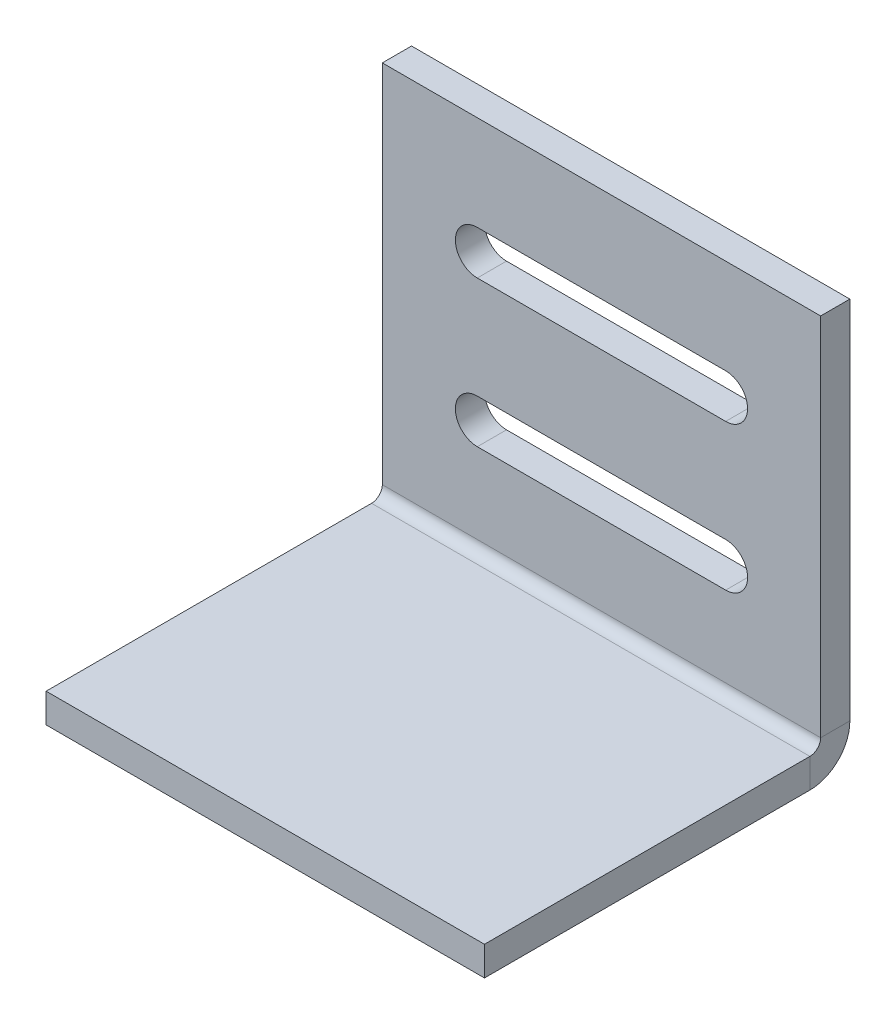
ISO-10303-21;
HEADER;
FILE_DESCRIPTION(('STEP AP214'),'2;1');
FILE_NAME('part.step','',(''),(''),'','','');
FILE_SCHEMA(('AUTOMOTIVE_DESIGN { 1 0 10303 214 1 1 1 1 }'));
ENDSEC;
DATA;
#1=APPLICATION_CONTEXT('core data for automotive mechanical design processes');
#2=APPLICATION_PROTOCOL_DEFINITION('international standard','automotive_design',2000,#1);
#3=PRODUCT_CONTEXT('',#1,'mechanical');
#4=PRODUCT('Part','Part','',(#3));
#5=PRODUCT_RELATED_PRODUCT_CATEGORY('part','',(#4));
#6=PRODUCT_DEFINITION_FORMATION('','',#4);
#7=PRODUCT_DEFINITION_CONTEXT('part definition',#1,'design');
#8=PRODUCT_DEFINITION('design','',#6,#7);
#9=PRODUCT_DEFINITION_SHAPE('','',#8);
#10=(LENGTH_UNIT() NAMED_UNIT(*) SI_UNIT(.MILLI.,.METRE.));
#11=(NAMED_UNIT(*) PLANE_ANGLE_UNIT() SI_UNIT($,.RADIAN.));
#12=(NAMED_UNIT(*) SI_UNIT($,.STERADIAN.) SOLID_ANGLE_UNIT());
#13=UNCERTAINTY_MEASURE_WITH_UNIT(LENGTH_MEASURE(1.E-05),#10,'distance_accuracy_value','');
#14=(GEOMETRIC_REPRESENTATION_CONTEXT(3) GLOBAL_UNCERTAINTY_ASSIGNED_CONTEXT((#13)) GLOBAL_UNIT_ASSIGNED_CONTEXT((#10,
#11,#12)) REPRESENTATION_CONTEXT('',''));
#15=CARTESIAN_POINT('',(0.,0.,0.));
#16=DIRECTION('',(0.,0.,1.));
#17=DIRECTION('',(1.,0.,0.));
#18=AXIS2_PLACEMENT_3D('',#15,#16,#17);
#19=CARTESIAN_POINT('',(-15.,-0.736599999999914,25.008755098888));
#20=DIRECTION('',(0.,1.,0.));
#21=DIRECTION('',(1.,0.,0.));
#22=AXIS2_PLACEMENT_3D('',#19,#20,#21);
#23=PLANE('',#22);
#24=DIRECTION('',(0.,0.,-1.));
#25=VECTOR('',#24,1.);
#26=CARTESIAN_POINT('',(15.,-0.736600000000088,-24.991244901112));
#27=LINE('',#26,#25);
#28=CARTESIAN_POINT('',(15.,-0.736599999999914,25.008755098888));
#29=VERTEX_POINT('',#28);
#30=CARTESIAN_POINT('',(15.,-0.7366,2.7366));
#31=VERTEX_POINT('',#30);
#32=EDGE_CURVE('E50',#29,#31,#27,.T.);
#33=ORIENTED_EDGE('',*,*,#32,.T.);
#34=DIRECTION('',(-1.,0.,0.));
#35=VECTOR('',#34,1.);
#36=CARTESIAN_POINT('',(-15.,-0.736599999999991,2.73660000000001));
#37=LINE('',#36,#35);
#38=CARTESIAN_POINT('',(-15.,-0.736599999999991,2.7366));
#39=VERTEX_POINT('',#38);
#40=EDGE_CURVE('E171',#31,#39,#37,.T.);
#41=ORIENTED_EDGE('',*,*,#40,.T.);
#42=DIRECTION('',(0.,0.,1.));
#43=VECTOR('',#42,1.);
#44=CARTESIAN_POINT('',(-15.,-0.736600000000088,-24.991244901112));
#45=LINE('',#44,#43);
#46=CARTESIAN_POINT('',(-15.,-0.736599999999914,25.008755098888));
#47=VERTEX_POINT('',#46);
#48=EDGE_CURVE('E190',#39,#47,#45,.T.);
#49=ORIENTED_EDGE('',*,*,#48,.T.);
#50=DIRECTION('',(1.,0.,0.));
#51=VECTOR('',#50,1.);
#52=CARTESIAN_POINT('',(-15.,-0.736599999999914,25.008755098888));
#53=LINE('',#52,#51);
#54=EDGE_CURVE('E70',#47,#29,#53,.T.);
#55=ORIENTED_EDGE('',*,*,#54,.T.);
#56=EDGE_LOOP('',(#33,#41,#49,#55));
#57=FACE_BOUND('',#56,.T.);
#58=ADVANCED_FACE('F46',(#57),#23,.T.);
#59=CARTESIAN_POINT('',(-15.,-0.736600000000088,-24.991244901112));
#60=DIRECTION('',(1.,0.,0.));
#61=DIRECTION('',(0.,0.,-1.));
#62=AXIS2_PLACEMENT_3D('',#59,#60,#61);
#63=PLANE('',#62);
#64=DIRECTION('',(0.,1.,0.));
#65=VECTOR('',#64,1.);
#66=CARTESIAN_POINT('',(-15.,-0.736600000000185,2.73660000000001));
#67=LINE('',#66,#65);
#68=CARTESIAN_POINT('',(-15.,-2.7366,2.7366));
#69=VERTEX_POINT('',#68);
#70=EDGE_CURVE('E12',#69,#39,#67,.T.);
#71=ORIENTED_EDGE('',*,*,#70,.F.);
#72=DIRECTION('',(0.,0.,1.));
#73=VECTOR('',#72,1.);
#74=CARTESIAN_POINT('',(-15.,-2.73660000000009,-24.991244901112));
#75=LINE('',#74,#73);
#76=CARTESIAN_POINT('',(-15.,-2.73659999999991,25.008755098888));
#77=VERTEX_POINT('',#76);
#78=EDGE_CURVE('E195',#69,#77,#75,.T.);
#79=ORIENTED_EDGE('',*,*,#78,.T.);
#80=DIRECTION('',(0.,-1.,0.));
#81=VECTOR('',#80,1.);
#82=CARTESIAN_POINT('',(-15.,-0.736599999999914,25.008755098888));
#83=LINE('',#82,#81);
#84=EDGE_CURVE('E208',#47,#77,#83,.T.);
#85=ORIENTED_EDGE('',*,*,#84,.F.);
#86=ORIENTED_EDGE('',*,*,#48,.F.);
#87=EDGE_LOOP('',(#71,#79,#85,#86));
#88=FACE_BOUND('',#87,.T.);
#89=ADVANCED_FACE('F48',(#88),#63,.F.);
#90=CARTESIAN_POINT('',(-15.,-0.736599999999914,25.008755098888));
#91=DIRECTION('',(0.,0.,-1.));
#92=DIRECTION('',(-1.,0.,0.));
#93=AXIS2_PLACEMENT_3D('',#90,#91,#92);
#94=PLANE('',#93);
#95=DIRECTION('',(1.,0.,0.));
#96=VECTOR('',#95,1.);
#97=CARTESIAN_POINT('',(-15.,-2.73659999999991,25.008755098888));
#98=LINE('',#97,#96);
#99=CARTESIAN_POINT('',(15.,-2.73659999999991,25.008755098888));
#100=VERTEX_POINT('',#99);
#101=EDGE_CURVE('E191',#77,#100,#98,.T.);
#102=ORIENTED_EDGE('',*,*,#101,.T.);
#103=DIRECTION('',(0.,-1.,0.));
#104=VECTOR('',#103,1.);
#105=CARTESIAN_POINT('',(15.,-0.736599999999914,25.008755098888));
#106=LINE('',#105,#104);
#107=EDGE_CURVE('E187',#29,#100,#106,.T.);
#108=ORIENTED_EDGE('',*,*,#107,.F.);
#109=ORIENTED_EDGE('',*,*,#54,.F.);
#110=ORIENTED_EDGE('',*,*,#84,.T.);
#111=EDGE_LOOP('',(#102,#108,#109,#110));
#112=FACE_BOUND('',#111,.T.);
#113=ADVANCED_FACE('F213',(#112),#94,.F.);
#114=CARTESIAN_POINT('',(15.,-0.736600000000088,-24.991244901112));
#115=DIRECTION('',(-1.,0.,0.));
#116=DIRECTION('',(0.,0.,1.));
#117=AXIS2_PLACEMENT_3D('',#114,#115,#116);
#118=PLANE('',#117);
#119=DIRECTION('',(0.,-1.,0.));
#120=VECTOR('',#119,1.);
#121=CARTESIAN_POINT('',(15.,-0.736600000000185,2.73660000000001));
#122=LINE('',#121,#120);
#123=CARTESIAN_POINT('',(15.,-2.7366,2.7366));
#124=VERTEX_POINT('',#123);
#125=EDGE_CURVE('E161',#31,#124,#122,.T.);
#126=ORIENTED_EDGE('',*,*,#125,.F.);
#127=ORIENTED_EDGE('',*,*,#32,.F.);
#128=ORIENTED_EDGE('',*,*,#107,.T.);
#129=DIRECTION('',(0.,0.,-1.));
#130=VECTOR('',#129,1.);
#131=CARTESIAN_POINT('',(15.,-2.73660000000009,-24.991244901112));
#132=LINE('',#131,#130);
#133=EDGE_CURVE('E185',#100,#124,#132,.T.);
#134=ORIENTED_EDGE('',*,*,#133,.T.);
#135=EDGE_LOOP('',(#126,#127,#128,#134));
#136=FACE_BOUND('',#135,.T.);
#137=ADVANCED_FACE('F186',(#136),#118,.F.);
#138=CARTESIAN_POINT('',(-15.,-2.73659999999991,25.008755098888));
#139=DIRECTION('',(0.,1.,0.));
#140=DIRECTION('',(1.,0.,0.));
#141=AXIS2_PLACEMENT_3D('',#138,#139,#140);
#142=PLANE('',#141);
#143=DIRECTION('',(-1.,0.,0.));
#144=VECTOR('',#143,1.);
#145=CARTESIAN_POINT('',(-15.,-2.73659999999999,2.7366));
#146=LINE('',#145,#144);
#147=EDGE_CURVE('E55',#124,#69,#146,.T.);
#148=ORIENTED_EDGE('',*,*,#147,.F.);
#149=ORIENTED_EDGE('',*,*,#133,.F.);
#150=ORIENTED_EDGE('',*,*,#101,.F.);
#151=ORIENTED_EDGE('',*,*,#78,.F.);
#152=EDGE_LOOP('',(#148,#149,#150,#151));
#153=FACE_BOUND('',#152,.T.);
#154=ADVANCED_FACE('F194',(#153),#142,.F.);
#155=CARTESIAN_POINT('',(8.50000000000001,18.5,0.));
#156=DIRECTION('',(0.,1.,0.));
#157=DIRECTION('',(0.,0.,1.));
#158=AXIS2_PLACEMENT_3D('',#155,#156,#157);
#159=PLANE('',#158);
#160=DIRECTION('',(-1.,0.,0.));
#161=VECTOR('',#160,1.);
#162=CARTESIAN_POINT('',(8.50000000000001,18.5,2.));
#163=LINE('',#162,#161);
#164=CARTESIAN_POINT('',(8.50000000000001,18.5,2.));
#165=VERTEX_POINT('',#164);
#166=CARTESIAN_POINT('',(-8.49999999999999,18.5,2.));
#167=VERTEX_POINT('',#166);
#168=EDGE_CURVE('E382',#165,#167,#163,.T.);
#169=ORIENTED_EDGE('',*,*,#168,.T.);
#170=DIRECTION('',(0.,0.,1.));
#171=VECTOR('',#170,1.);
#172=CARTESIAN_POINT('',(-8.49999999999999,18.5,0.));
#173=LINE('',#172,#171);
#174=CARTESIAN_POINT('',(-8.49999999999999,18.5,0.));
#175=VERTEX_POINT('',#174);
#176=EDGE_CURVE('E374',#175,#167,#173,.T.);
#177=ORIENTED_EDGE('',*,*,#176,.F.);
#178=DIRECTION('',(-1.,0.,0.));
#179=VECTOR('',#178,1.);
#180=CARTESIAN_POINT('',(8.50000000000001,18.5,0.));
#181=LINE('',#180,#179);
#182=CARTESIAN_POINT('',(8.50000000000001,18.5,0.));
#183=VERTEX_POINT('',#182);
#184=EDGE_CURVE('E321',#183,#175,#181,.T.);
#185=ORIENTED_EDGE('',*,*,#184,.F.);
#186=DIRECTION('',(0.,0.,1.));
#187=VECTOR('',#186,1.);
#188=CARTESIAN_POINT('',(8.50000000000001,18.5,0.));
#189=LINE('',#188,#187);
#190=EDGE_CURVE('E379',#183,#165,#189,.T.);
#191=ORIENTED_EDGE('',*,*,#190,.T.);
#192=EDGE_LOOP('',(#169,#177,#185,#191));
#193=FACE_BOUND('',#192,.T.);
#194=ADVANCED_FACE('F227',(#193),#159,.F.);
#195=CARTESIAN_POINT('',(-8.49999999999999,17.,0.));
#196=DIRECTION('',(0.,0.,1.));
#197=DIRECTION('',(1.,0.,0.));
#198=AXIS2_PLACEMENT_3D('',#195,#196,#197);
#199=CYLINDRICAL_SURFACE('',#198,1.5);
#200=CARTESIAN_POINT('',(-8.49999999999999,17.,2.));
#201=DIRECTION('',(0.,0.,1.));
#202=DIRECTION('',(1.,0.,0.));
#203=AXIS2_PLACEMENT_3D('',#200,#201,#202);
#204=CIRCLE('',#203,1.5);
#205=CARTESIAN_POINT('',(-8.49999999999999,15.5,2.));
#206=VERTEX_POINT('',#205);
#207=EDGE_CURVE('E376',#167,#206,#204,.T.);
#208=ORIENTED_EDGE('',*,*,#207,.T.);
#209=DIRECTION('',(0.,0.,1.));
#210=VECTOR('',#209,1.);
#211=CARTESIAN_POINT('',(-8.49999999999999,15.5,0.));
#212=LINE('',#211,#210);
#213=CARTESIAN_POINT('',(-8.49999999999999,15.5,0.));
#214=VERTEX_POINT('',#213);
#215=EDGE_CURVE('E369',#214,#206,#212,.T.);
#216=ORIENTED_EDGE('',*,*,#215,.F.);
#217=CARTESIAN_POINT('',(-8.49999999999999,17.,0.));
#218=DIRECTION('',(0.,0.,1.));
#219=DIRECTION('',(1.,0.,0.));
#220=AXIS2_PLACEMENT_3D('',#217,#218,#219);
#221=CIRCLE('',#220,1.5);
#222=EDGE_CURVE('E318',#175,#214,#221,.T.);
#223=ORIENTED_EDGE('',*,*,#222,.F.);
#224=ORIENTED_EDGE('',*,*,#176,.T.);
#225=EDGE_LOOP('',(#208,#216,#223,#224));
#226=FACE_BOUND('',#225,.T.);
#227=ADVANCED_FACE('F231',(#226),#199,.F.);
#228=CARTESIAN_POINT('',(8.50000000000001,15.5,0.));
#229=DIRECTION('',(0.,-1.,0.));
#230=DIRECTION('',(0.,0.,-1.));
#231=AXIS2_PLACEMENT_3D('',#228,#229,#230);
#232=PLANE('',#231);
#233=DIRECTION('',(1.,0.,0.));
#234=VECTOR('',#233,1.);
#235=CARTESIAN_POINT('',(8.50000000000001,15.5,2.));
#236=LINE('',#235,#234);
#237=CARTESIAN_POINT('',(8.50000000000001,15.5,2.));
#238=VERTEX_POINT('',#237);
#239=EDGE_CURVE('E371',#206,#238,#236,.T.);
#240=ORIENTED_EDGE('',*,*,#239,.T.);
#241=DIRECTION('',(0.,0.,1.));
#242=VECTOR('',#241,1.);
#243=CARTESIAN_POINT('',(8.50000000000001,15.5,0.));
#244=LINE('',#243,#242);
#245=CARTESIAN_POINT('',(8.50000000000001,15.5,0.));
#246=VERTEX_POINT('',#245);
#247=EDGE_CURVE('E365',#246,#238,#244,.T.);
#248=ORIENTED_EDGE('',*,*,#247,.F.);
#249=DIRECTION('',(1.,0.,0.));
#250=VECTOR('',#249,1.);
#251=CARTESIAN_POINT('',(8.50000000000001,15.5,0.));
#252=LINE('',#251,#250);
#253=EDGE_CURVE('E327',#214,#246,#252,.T.);
#254=ORIENTED_EDGE('',*,*,#253,.F.);
#255=ORIENTED_EDGE('',*,*,#215,.T.);
#256=EDGE_LOOP('',(#240,#248,#254,#255));
#257=FACE_BOUND('',#256,.T.);
#258=ADVANCED_FACE('F237',(#257),#232,.F.);
#259=CARTESIAN_POINT('',(8.50000000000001,17.,0.));
#260=DIRECTION('',(0.,0.,1.));
#261=DIRECTION('',(1.,0.,0.));
#262=AXIS2_PLACEMENT_3D('',#259,#260,#261);
#263=CYLINDRICAL_SURFACE('',#262,1.5);
#264=CARTESIAN_POINT('',(8.50000000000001,17.,2.));
#265=DIRECTION('',(0.,0.,1.));
#266=DIRECTION('',(-1.,0.,0.));
#267=AXIS2_PLACEMENT_3D('',#264,#265,#266);
#268=CIRCLE('',#267,1.5);
#269=EDGE_CURVE('E367',#238,#165,#268,.T.);
#270=ORIENTED_EDGE('',*,*,#269,.T.);
#271=ORIENTED_EDGE('',*,*,#190,.F.);
#272=CARTESIAN_POINT('',(8.50000000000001,17.,0.));
#273=DIRECTION('',(0.,0.,1.));
#274=DIRECTION('',(-1.,0.,0.));
#275=AXIS2_PLACEMENT_3D('',#272,#273,#274);
#276=CIRCLE('',#275,1.5);
#277=EDGE_CURVE('E324',#246,#183,#276,.T.);
#278=ORIENTED_EDGE('',*,*,#277,.F.);
#279=ORIENTED_EDGE('',*,*,#247,.T.);
#280=EDGE_LOOP('',(#270,#271,#278,#279));
#281=FACE_BOUND('',#280,.T.);
#282=ADVANCED_FACE('F247',(#281),#263,.F.);
#283=CARTESIAN_POINT('',(8.50000000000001,8.50000000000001,0.));
#284=DIRECTION('',(0.,1.,0.));
#285=DIRECTION('',(0.,0.,1.));
#286=AXIS2_PLACEMENT_3D('',#283,#284,#285);
#287=PLANE('',#286);
#288=DIRECTION('',(-1.,0.,0.));
#289=VECTOR('',#288,1.);
#290=CARTESIAN_POINT('',(8.50000000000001,8.50000000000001,2.));
#291=LINE('',#290,#289);
#292=CARTESIAN_POINT('',(8.50000000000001,8.50000000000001,2.));
#293=VERTEX_POINT('',#292);
#294=CARTESIAN_POINT('',(-8.49999999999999,8.50000000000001,2.));
#295=VERTEX_POINT('',#294);
#296=EDGE_CURVE('E362',#293,#295,#291,.T.);
#297=ORIENTED_EDGE('',*,*,#296,.T.);
#298=DIRECTION('',(0.,0.,1.));
#299=VECTOR('',#298,1.);
#300=CARTESIAN_POINT('',(-8.49999999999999,8.50000000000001,0.));
#301=LINE('',#300,#299);
#302=CARTESIAN_POINT('',(-8.49999999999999,8.50000000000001,0.));
#303=VERTEX_POINT('',#302);
#304=EDGE_CURVE('E354',#303,#295,#301,.T.);
#305=ORIENTED_EDGE('',*,*,#304,.F.);
#306=DIRECTION('',(-1.,0.,0.));
#307=VECTOR('',#306,1.);
#308=CARTESIAN_POINT('',(8.50000000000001,8.50000000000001,0.));
#309=LINE('',#308,#307);
#310=CARTESIAN_POINT('',(8.50000000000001,8.50000000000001,0.));
#311=VERTEX_POINT('',#310);
#312=EDGE_CURVE('E306',#311,#303,#309,.T.);
#313=ORIENTED_EDGE('',*,*,#312,.F.);
#314=DIRECTION('',(0.,0.,1.));
#315=VECTOR('',#314,1.);
#316=CARTESIAN_POINT('',(8.50000000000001,8.50000000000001,0.));
#317=LINE('',#316,#315);
#318=EDGE_CURVE('E359',#311,#293,#317,.T.);
#319=ORIENTED_EDGE('',*,*,#318,.T.);
#320=EDGE_LOOP('',(#297,#305,#313,#319));
#321=FACE_BOUND('',#320,.T.);
#322=ADVANCED_FACE('F251',(#321),#287,.F.);
#323=CARTESIAN_POINT('',(-8.49999999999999,7.00000000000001,0.));
#324=DIRECTION('',(0.,0.,1.));
#325=DIRECTION('',(1.,0.,0.));
#326=AXIS2_PLACEMENT_3D('',#323,#324,#325);
#327=CYLINDRICAL_SURFACE('',#326,1.5);
#328=CARTESIAN_POINT('',(-8.49999999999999,7.00000000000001,2.));
#329=DIRECTION('',(0.,0.,1.));
#330=DIRECTION('',(1.,0.,0.));
#331=AXIS2_PLACEMENT_3D('',#328,#329,#330);
#332=CIRCLE('',#331,1.5);
#333=CARTESIAN_POINT('',(-8.49999999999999,5.50000000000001,2.));
#334=VERTEX_POINT('',#333);
#335=EDGE_CURVE('E356',#295,#334,#332,.T.);
#336=ORIENTED_EDGE('',*,*,#335,.T.);
#337=DIRECTION('',(0.,0.,1.));
#338=VECTOR('',#337,1.);
#339=CARTESIAN_POINT('',(-8.49999999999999,5.50000000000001,0.));
#340=LINE('',#339,#338);
#341=CARTESIAN_POINT('',(-8.49999999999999,5.50000000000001,0.));
#342=VERTEX_POINT('',#341);
#343=EDGE_CURVE('E349',#342,#334,#340,.T.);
#344=ORIENTED_EDGE('',*,*,#343,.F.);
#345=CARTESIAN_POINT('',(-8.49999999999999,7.00000000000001,0.));
#346=DIRECTION('',(0.,0.,1.));
#347=DIRECTION('',(1.,0.,0.));
#348=AXIS2_PLACEMENT_3D('',#345,#346,#347);
#349=CIRCLE('',#348,1.5);
#350=EDGE_CURVE('E303',#303,#342,#349,.T.);
#351=ORIENTED_EDGE('',*,*,#350,.F.);
#352=ORIENTED_EDGE('',*,*,#304,.T.);
#353=EDGE_LOOP('',(#336,#344,#351,#352));
#354=FACE_BOUND('',#353,.T.);
#355=ADVANCED_FACE('F255',(#354),#327,.F.);
#356=CARTESIAN_POINT('',(8.50000000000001,5.50000000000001,0.));
#357=DIRECTION('',(0.,-1.,0.));
#358=DIRECTION('',(0.,0.,-1.));
#359=AXIS2_PLACEMENT_3D('',#356,#357,#358);
#360=PLANE('',#359);
#361=DIRECTION('',(1.,0.,0.));
#362=VECTOR('',#361,1.);
#363=CARTESIAN_POINT('',(8.50000000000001,5.50000000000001,2.));
#364=LINE('',#363,#362);
#365=CARTESIAN_POINT('',(8.50000000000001,5.50000000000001,2.));
#366=VERTEX_POINT('',#365);
#367=EDGE_CURVE('E351',#334,#366,#364,.T.);
#368=ORIENTED_EDGE('',*,*,#367,.T.);
#369=DIRECTION('',(0.,0.,1.));
#370=VECTOR('',#369,1.);
#371=CARTESIAN_POINT('',(8.50000000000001,5.50000000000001,0.));
#372=LINE('',#371,#370);
#373=CARTESIAN_POINT('',(8.50000000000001,5.50000000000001,0.));
#374=VERTEX_POINT('',#373);
#375=EDGE_CURVE('E345',#374,#366,#372,.T.);
#376=ORIENTED_EDGE('',*,*,#375,.F.);
#377=DIRECTION('',(1.,0.,0.));
#378=VECTOR('',#377,1.);
#379=CARTESIAN_POINT('',(8.50000000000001,5.50000000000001,0.));
#380=LINE('',#379,#378);
#381=EDGE_CURVE('E315',#342,#374,#380,.T.);
#382=ORIENTED_EDGE('',*,*,#381,.F.);
#383=ORIENTED_EDGE('',*,*,#343,.T.);
#384=EDGE_LOOP('',(#368,#376,#382,#383));
#385=FACE_BOUND('',#384,.T.);
#386=ADVANCED_FACE('F259',(#385),#360,.F.);
#387=CARTESIAN_POINT('',(8.50000000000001,7.00000000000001,0.));
#388=DIRECTION('',(0.,0.,1.));
#389=DIRECTION('',(1.,0.,0.));
#390=AXIS2_PLACEMENT_3D('',#387,#388,#389);
#391=CYLINDRICAL_SURFACE('',#390,1.5);
#392=CARTESIAN_POINT('',(8.50000000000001,7.00000000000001,2.));
#393=DIRECTION('',(0.,0.,1.));
#394=DIRECTION('',(-1.,0.,0.));
#395=AXIS2_PLACEMENT_3D('',#392,#393,#394);
#396=CIRCLE('',#395,1.5);
#397=EDGE_CURVE('E347',#366,#293,#396,.T.);
#398=ORIENTED_EDGE('',*,*,#397,.T.);
#399=ORIENTED_EDGE('',*,*,#318,.F.);
#400=CARTESIAN_POINT('',(8.50000000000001,7.00000000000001,0.));
#401=DIRECTION('',(0.,0.,1.));
#402=DIRECTION('',(-1.,0.,0.));
#403=AXIS2_PLACEMENT_3D('',#400,#401,#402);
#404=CIRCLE('',#403,1.5);
#405=EDGE_CURVE('E312',#374,#311,#404,.T.);
#406=ORIENTED_EDGE('',*,*,#405,.F.);
#407=ORIENTED_EDGE('',*,*,#375,.T.);
#408=EDGE_LOOP('',(#398,#399,#406,#407));
#409=FACE_BOUND('',#408,.T.);
#410=ADVANCED_FACE('F263',(#409),#391,.F.);
#411=CARTESIAN_POINT('',(-15.,25.,2.));
#412=DIRECTION('',(0.,-1.,0.));
#413=DIRECTION('',(1.,0.,0.));
#414=AXIS2_PLACEMENT_3D('',#411,#412,#413);
#415=PLANE('',#414);
#416=DIRECTION('',(-1.,0.,0.));
#417=VECTOR('',#416,1.);
#418=CARTESIAN_POINT('',(-15.,25.,0.));
#419=LINE('',#418,#417);
#420=CARTESIAN_POINT('',(15.,25.,0.));
#421=VERTEX_POINT('',#420);
#422=CARTESIAN_POINT('',(-15.,25.,0.));
#423=VERTEX_POINT('',#422);
#424=EDGE_CURVE('E343',#421,#423,#419,.T.);
#425=ORIENTED_EDGE('',*,*,#424,.T.);
#426=DIRECTION('',(0.,0.,-1.));
#427=VECTOR('',#426,1.);
#428=CARTESIAN_POINT('',(-15.,25.,2.));
#429=LINE('',#428,#427);
#430=CARTESIAN_POINT('',(-15.,25.,2.));
#431=VERTEX_POINT('',#430);
#432=EDGE_CURVE('E200',#431,#423,#429,.T.);
#433=ORIENTED_EDGE('',*,*,#432,.F.);
#434=DIRECTION('',(-1.,0.,0.));
#435=VECTOR('',#434,1.);
#436=CARTESIAN_POINT('',(-15.,25.,2.));
#437=LINE('',#436,#435);
#438=CARTESIAN_POINT('',(15.,25.,2.));
#439=VERTEX_POINT('',#438);
#440=EDGE_CURVE('E336',#439,#431,#437,.T.);
#441=ORIENTED_EDGE('',*,*,#440,.F.);
#442=DIRECTION('',(0.,0.,-1.));
#443=VECTOR('',#442,1.);
#444=CARTESIAN_POINT('',(15.,25.,2.));
#445=LINE('',#444,#443);
#446=EDGE_CURVE('E340',#439,#421,#445,.T.);
#447=ORIENTED_EDGE('',*,*,#446,.T.);
#448=EDGE_LOOP('',(#425,#433,#441,#447));
#449=FACE_BOUND('',#448,.T.);
#450=ADVANCED_FACE('F267',(#449),#415,.F.);
#451=CARTESIAN_POINT('',(-15.,-25.,2.));
#452=DIRECTION('',(0.,0.,1.));
#453=DIRECTION('',(1.,0.,0.));
#454=AXIS2_PLACEMENT_3D('',#451,#452,#453);
#455=PLANE('',#454);
#456=DIRECTION('',(-1.,0.,0.));
#457=VECTOR('',#456,1.);
#458=CARTESIAN_POINT('',(-15.,0.,2.));
#459=LINE('',#458,#457);
#460=CARTESIAN_POINT('',(15.,0.,2.));
#461=VERTEX_POINT('',#460);
#462=CARTESIAN_POINT('',(-15.,0.,2.));
#463=VERTEX_POINT('',#462);
#464=EDGE_CURVE('E383',#461,#463,#459,.T.);
#465=ORIENTED_EDGE('',*,*,#464,.F.);
#466=DIRECTION('',(0.,1.,0.));
#467=VECTOR('',#466,1.);
#468=CARTESIAN_POINT('',(15.,25.,2.));
#469=LINE('',#468,#467);
#470=EDGE_CURVE('E338',#461,#439,#469,.T.);
#471=ORIENTED_EDGE('',*,*,#470,.T.);
#472=ORIENTED_EDGE('',*,*,#440,.T.);
#473=DIRECTION('',(0.,-1.,0.));
#474=VECTOR('',#473,1.);
#475=CARTESIAN_POINT('',(-15.,25.,2.));
#476=LINE('',#475,#474);
#477=EDGE_CURVE('E333',#431,#463,#476,.T.);
#478=ORIENTED_EDGE('',*,*,#477,.T.);
#479=EDGE_LOOP('',(#465,#471,#472,#478));
#480=FACE_BOUND('',#479,.T.);
#481=ORIENTED_EDGE('',*,*,#397,.F.);
#482=ORIENTED_EDGE('',*,*,#367,.F.);
#483=ORIENTED_EDGE('',*,*,#335,.F.);
#484=ORIENTED_EDGE('',*,*,#296,.F.);
#485=EDGE_LOOP('',(#481,#482,#483,#484));
#486=FACE_BOUND('',#485,.T.);
#487=ORIENTED_EDGE('',*,*,#269,.F.);
#488=ORIENTED_EDGE('',*,*,#239,.F.);
#489=ORIENTED_EDGE('',*,*,#207,.F.);
#490=ORIENTED_EDGE('',*,*,#168,.F.);
#491=EDGE_LOOP('',(#487,#488,#489,#490));
#492=FACE_BOUND('',#491,.T.);
#493=ADVANCED_FACE('F271',(#480,#486,#492),#455,.T.);
#494=CARTESIAN_POINT('',(15.,25.,2.));
#495=DIRECTION('',(-1.,0.,0.));
#496=DIRECTION('',(0.,-1.,0.));
#497=AXIS2_PLACEMENT_3D('',#494,#495,#496);
#498=PLANE('',#497);
#499=ORIENTED_EDGE('',*,*,#470,.F.);
#500=DIRECTION('',(0.,0.,-1.));
#501=VECTOR('',#500,1.);
#502=CARTESIAN_POINT('',(15.,0.,1.99999999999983));
#503=LINE('',#502,#501);
#504=CARTESIAN_POINT('',(15.,0.,0.));
#505=VERTEX_POINT('',#504);
#506=EDGE_CURVE('E331',#461,#505,#503,.T.);
#507=ORIENTED_EDGE('',*,*,#506,.T.);
#508=DIRECTION('',(0.,1.,0.));
#509=VECTOR('',#508,1.);
#510=CARTESIAN_POINT('',(15.,25.,0.));
#511=LINE('',#510,#509);
#512=EDGE_CURVE('E301',#505,#421,#511,.T.);
#513=ORIENTED_EDGE('',*,*,#512,.T.);
#514=ORIENTED_EDGE('',*,*,#446,.F.);
#515=EDGE_LOOP('',(#499,#507,#513,#514));
#516=FACE_BOUND('',#515,.T.);
#517=ADVANCED_FACE('F275',(#516),#498,.F.);
#518=CARTESIAN_POINT('',(-15.,-25.,0.));
#519=DIRECTION('',(0.,0.,1.));
#520=DIRECTION('',(1.,0.,0.));
#521=AXIS2_PLACEMENT_3D('',#518,#519,#520);
#522=PLANE('',#521);
#523=ORIENTED_EDGE('',*,*,#253,.T.);
#524=ORIENTED_EDGE('',*,*,#277,.T.);
#525=ORIENTED_EDGE('',*,*,#184,.T.);
#526=ORIENTED_EDGE('',*,*,#222,.T.);
#527=EDGE_LOOP('',(#523,#524,#525,#526));
#528=FACE_BOUND('',#527,.T.);
#529=ORIENTED_EDGE('',*,*,#381,.T.);
#530=ORIENTED_EDGE('',*,*,#405,.T.);
#531=ORIENTED_EDGE('',*,*,#312,.T.);
#532=ORIENTED_EDGE('',*,*,#350,.T.);
#533=EDGE_LOOP('',(#529,#530,#531,#532));
#534=FACE_BOUND('',#533,.T.);
#535=ORIENTED_EDGE('',*,*,#512,.F.);
#536=DIRECTION('',(-1.,0.,0.));
#537=VECTOR('',#536,1.);
#538=CARTESIAN_POINT('',(-15.,0.,0.));
#539=LINE('',#538,#537);
#540=CARTESIAN_POINT('',(-15.,0.,0.));
#541=VERTEX_POINT('',#540);
#542=EDGE_CURVE('E179',#505,#541,#539,.T.);
#543=ORIENTED_EDGE('',*,*,#542,.T.);
#544=DIRECTION('',(0.,-1.,0.));
#545=VECTOR('',#544,1.);
#546=CARTESIAN_POINT('',(-15.,25.,0.));
#547=LINE('',#546,#545);
#548=EDGE_CURVE('E294',#423,#541,#547,.T.);
#549=ORIENTED_EDGE('',*,*,#548,.F.);
#550=ORIENTED_EDGE('',*,*,#424,.F.);
#551=EDGE_LOOP('',(#535,#543,#549,#550));
#552=FACE_BOUND('',#551,.T.);
#553=ADVANCED_FACE('F279',(#528,#534,#552),#522,.F.);
#554=CARTESIAN_POINT('',(-15.,25.,2.));
#555=DIRECTION('',(1.,0.,0.));
#556=DIRECTION('',(0.,1.,0.));
#557=AXIS2_PLACEMENT_3D('',#554,#555,#556);
#558=PLANE('',#557);
#559=ORIENTED_EDGE('',*,*,#548,.T.);
#560=DIRECTION('',(0.,0.,1.));
#561=VECTOR('',#560,1.);
#562=CARTESIAN_POINT('',(-15.,0.,1.99999999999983));
#563=LINE('',#562,#561);
#564=EDGE_CURVE('E296',#541,#463,#563,.T.);
#565=ORIENTED_EDGE('',*,*,#564,.T.);
#566=ORIENTED_EDGE('',*,*,#477,.F.);
#567=ORIENTED_EDGE('',*,*,#432,.T.);
#568=EDGE_LOOP('',(#559,#565,#566,#567));
#569=FACE_BOUND('',#568,.T.);
#570=ADVANCED_FACE('F282',(#569),#558,.F.);
#571=CARTESIAN_POINT('',(15.,0.,2.7366));
#572=DIRECTION('',(-1.,0.,0.));
#573=DIRECTION('',(0.,0.,1.));
#574=AXIS2_PLACEMENT_3D('',#571,#572,#573);
#575=PLANE('',#574);
#576=ORIENTED_EDGE('',*,*,#125,.T.);
#577=CARTESIAN_POINT('',(15.,0.,2.7366));
#578=DIRECTION('',(1.,0.,0.));
#579=DIRECTION('',(0.,0.,-1.));
#580=AXIS2_PLACEMENT_3D('',#577,#578,#579);
#581=CIRCLE('',#580,2.7366);
#582=EDGE_CURVE('E164',#124,#505,#581,.T.);
#583=ORIENTED_EDGE('',*,*,#582,.T.);
#584=ORIENTED_EDGE('',*,*,#506,.F.);
#585=CARTESIAN_POINT('',(15.,0.,2.7366));
#586=DIRECTION('',(1.,0.,0.));
#587=DIRECTION('',(0.,0.,-1.));
#588=AXIS2_PLACEMENT_3D('',#585,#586,#587);
#589=CIRCLE('',#588,0.7366);
#590=EDGE_CURVE('E167',#31,#461,#589,.T.);
#591=ORIENTED_EDGE('',*,*,#590,.F.);
#592=EDGE_LOOP('',(#576,#583,#584,#591));
#593=FACE_BOUND('',#592,.T.);
#594=ADVANCED_FACE('F163',(#593),#575,.F.);
#595=CARTESIAN_POINT('',(-15.,0.,2.7366));
#596=DIRECTION('',(1.,0.,0.));
#597=DIRECTION('',(0.,0.,-1.));
#598=AXIS2_PLACEMENT_3D('',#595,#596,#597);
#599=PLANE('',#598);
#600=CARTESIAN_POINT('',(-15.,0.,2.7366));
#601=DIRECTION('',(1.,0.,0.));
#602=DIRECTION('',(0.,0.,-1.));
#603=AXIS2_PLACEMENT_3D('',#600,#601,#602);
#604=CIRCLE('',#603,2.7366);
#605=EDGE_CURVE('E181',#541,#69,#604,.F.);
#606=ORIENTED_EDGE('',*,*,#605,.T.);
#607=ORIENTED_EDGE('',*,*,#70,.T.);
#608=CARTESIAN_POINT('',(-15.,0.,2.7366));
#609=DIRECTION('',(-1.,0.,0.));
#610=DIRECTION('',(0.,0.,1.));
#611=AXIS2_PLACEMENT_3D('',#608,#609,#610);
#612=CIRCLE('',#611,0.7366);
#613=EDGE_CURVE('E63',#463,#39,#612,.T.);
#614=ORIENTED_EDGE('',*,*,#613,.F.);
#615=ORIENTED_EDGE('',*,*,#564,.F.);
#616=EDGE_LOOP('',(#606,#607,#614,#615));
#617=FACE_BOUND('',#616,.T.);
#618=ADVANCED_FACE('F242',(#617),#599,.F.);
#619=CARTESIAN_POINT('',(-30.1900834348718,0.,2.7366));
#620=DIRECTION('',(1.,0.,0.));
#621=DIRECTION('',(0.,0.,-1.));
#622=AXIS2_PLACEMENT_3D('',#619,#620,#621);
#623=CYLINDRICAL_SURFACE('',#622,0.7366);
#624=ORIENTED_EDGE('',*,*,#464,.T.);
#625=ORIENTED_EDGE('',*,*,#613,.T.);
#626=ORIENTED_EDGE('',*,*,#40,.F.);
#627=ORIENTED_EDGE('',*,*,#590,.T.);
#628=EDGE_LOOP('',(#624,#625,#626,#627));
#629=FACE_BOUND('',#628,.T.);
#630=ADVANCED_FACE('F289',(#629),#623,.F.);
#631=CARTESIAN_POINT('',(-30.1900834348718,0.,2.7366));
#632=DIRECTION('',(1.,0.,0.));
#633=DIRECTION('',(0.,0.,-1.));
#634=AXIS2_PLACEMENT_3D('',#631,#632,#633);
#635=CYLINDRICAL_SURFACE('',#634,2.7366);
#636=ORIENTED_EDGE('',*,*,#542,.F.);
#637=ORIENTED_EDGE('',*,*,#582,.F.);
#638=ORIENTED_EDGE('',*,*,#147,.T.);
#639=ORIENTED_EDGE('',*,*,#605,.F.);
#640=EDGE_LOOP('',(#636,#637,#638,#639));
#641=FACE_BOUND('',#640,.T.);
#642=ADVANCED_FACE('F174',(#641),#635,.T.);
#643=CLOSED_SHELL('',(#58,#89,#113,#137,#154,#194,#227,#258,#282,#322,#355,#386,#410,#450,#493,
#517,#553,#570,#594,#618,#630,#642));
#644=MANIFOLD_SOLID_BREP('B2',#643);
#645=ADVANCED_BREP_SHAPE_REPRESENTATION('',(#18,#644),#14);
#646=SHAPE_DEFINITION_REPRESENTATION(#9,#645);
ENDSEC;
END-ISO-10303-21;
